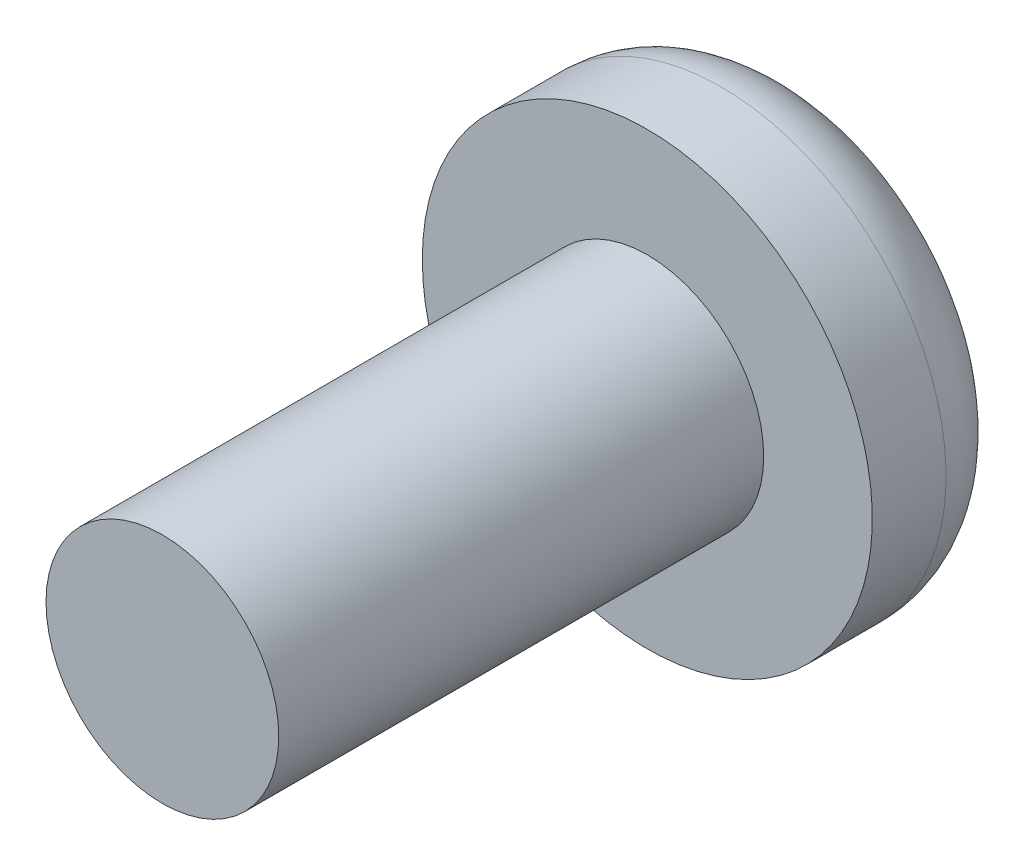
ISO-10303-21;
HEADER;
FILE_DESCRIPTION(('STEP AP214'),'2;1');
FILE_NAME('part.step','',(''),(''),'','','');
FILE_SCHEMA(('AUTOMOTIVE_DESIGN { 1 0 10303 214 1 1 1 1 }'));
ENDSEC;
DATA;
#1=APPLICATION_CONTEXT('core data for automotive mechanical design processes');
#2=APPLICATION_PROTOCOL_DEFINITION('international standard','automotive_design',2000,#1);
#3=PRODUCT_CONTEXT('',#1,'mechanical');
#4=PRODUCT('Part','Part','',(#3));
#5=PRODUCT_RELATED_PRODUCT_CATEGORY('part','',(#4));
#6=PRODUCT_DEFINITION_FORMATION('','',#4);
#7=PRODUCT_DEFINITION_CONTEXT('part definition',#1,'design');
#8=PRODUCT_DEFINITION('design','',#6,#7);
#9=PRODUCT_DEFINITION_SHAPE('','',#8);
#10=(LENGTH_UNIT() NAMED_UNIT(*) SI_UNIT(.MILLI.,.METRE.));
#11=(NAMED_UNIT(*) PLANE_ANGLE_UNIT() SI_UNIT($,.RADIAN.));
#12=(NAMED_UNIT(*) SI_UNIT($,.STERADIAN.) SOLID_ANGLE_UNIT());
#13=UNCERTAINTY_MEASURE_WITH_UNIT(LENGTH_MEASURE(1.E-05),#10,'distance_accuracy_value','');
#14=(GEOMETRIC_REPRESENTATION_CONTEXT(3) GLOBAL_UNCERTAINTY_ASSIGNED_CONTEXT((#13)) GLOBAL_UNIT_ASSIGNED_CONTEXT((#10,
#11,#12)) REPRESENTATION_CONTEXT('',''));
#15=CARTESIAN_POINT('',(0.,0.,0.));
#16=DIRECTION('',(0.,0.,1.));
#17=DIRECTION('',(1.,0.,0.));
#18=AXIS2_PLACEMENT_3D('',#15,#16,#17);
#19=CARTESIAN_POINT('',(0.,0.,-0.990600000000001));
#20=DIRECTION('',(0.,0.,-0.999999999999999));
#21=DIRECTION('',(-1.,0.,0.));
#22=AXIS2_PLACEMENT_3D('',#19,#20,#21);
#23=PLANE('',#22);
#24=CARTESIAN_POINT('',(0.,0.,-0.990600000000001));
#25=DIRECTION('',(0.,0.,-0.999999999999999));
#26=DIRECTION('',(-1.,0.,0.));
#27=AXIS2_PLACEMENT_3D('',#24,#25,#26);
#28=CIRCLE('',#27,0.965200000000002);
#29=CARTESIAN_POINT('',(-0.96519999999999,0.,-0.990600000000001));
#30=VERTEX_POINT('',#29);
#31=EDGE_CURVE('E43',#30,#30,#28,.T.);
#32=ORIENTED_EDGE('',*,*,#31,.T.);
#33=EDGE_LOOP('',(#32));
#34=FACE_BOUND('',#33,.T.);
#35=DIRECTION('',(0.,-1.,0.));
#36=VECTOR('',#35,1.);
#37=CARTESIAN_POINT('',(0.761999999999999,0.228599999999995,-0.990599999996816));
#38=LINE('',#37,#36);
#39=CARTESIAN_POINT('',(0.761999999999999,0.228599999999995,-0.990599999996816));
#40=VERTEX_POINT('',#39);
#41=CARTESIAN_POINT('',(0.761999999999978,-0.228600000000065,-0.990599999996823));
#42=VERTEX_POINT('',#41);
#43=EDGE_CURVE('E194',#40,#42,#38,.T.);
#44=ORIENTED_EDGE('',*,*,#43,.F.);
#45=DIRECTION('',(-1.,0.,0.));
#46=VECTOR('',#45,1.);
#47=CARTESIAN_POINT('',(0.761999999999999,0.228599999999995,-0.990599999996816));
#48=LINE('',#47,#46);
#49=CARTESIAN_POINT('',(0.228600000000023,0.228599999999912,-0.990599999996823));
#50=VERTEX_POINT('',#49);
#51=EDGE_CURVE('E188',#40,#50,#48,.T.);
#52=ORIENTED_EDGE('',*,*,#51,.T.);
#53=DIRECTION('',(0.,1.,0.));
#54=VECTOR('',#53,1.);
#55=CARTESIAN_POINT('',(0.228600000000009,0.,-0.990599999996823));
#56=LINE('',#55,#54);
#57=CARTESIAN_POINT('',(0.228600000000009,0.761999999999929,-0.990599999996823));
#58=VERTEX_POINT('',#57);
#59=EDGE_CURVE('E63',#50,#58,#56,.T.);
#60=ORIENTED_EDGE('',*,*,#59,.T.);
#61=DIRECTION('',(1.,0.,0.));
#62=VECTOR('',#61,1.);
#63=CARTESIAN_POINT('',(-0.228599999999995,0.761999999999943,-0.990599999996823));
#64=LINE('',#63,#62);
#65=CARTESIAN_POINT('',(-0.228599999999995,0.761999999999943,-0.990599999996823));
#66=VERTEX_POINT('',#65);
#67=EDGE_CURVE('E215',#66,#58,#64,.T.);
#68=ORIENTED_EDGE('',*,*,#67,.F.);
#69=DIRECTION('',(0.,-1.,0.));
#70=VECTOR('',#69,1.);
#71=CARTESIAN_POINT('',(-0.228599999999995,0.761999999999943,-0.990599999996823));
#72=LINE('',#71,#70);
#73=CARTESIAN_POINT('',(-0.228600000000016,0.22859999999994,-0.990599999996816));
#74=VERTEX_POINT('',#73);
#75=EDGE_CURVE('E209',#66,#74,#72,.T.);
#76=ORIENTED_EDGE('',*,*,#75,.T.);
#77=CARTESIAN_POINT('',(-0.761999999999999,0.228599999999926,-0.990599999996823));
#78=VERTEX_POINT('',#77);
#79=EDGE_CURVE('E197',#74,#78,#48,.T.);
#80=ORIENTED_EDGE('',*,*,#79,.T.);
#81=DIRECTION('',(0.,1.,0.));
#82=VECTOR('',#81,1.);
#83=CARTESIAN_POINT('',(-0.762000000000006,-0.228600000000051,-0.990599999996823));
#84=LINE('',#83,#82);
#85=CARTESIAN_POINT('',(-0.762000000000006,-0.228600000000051,-0.990599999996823));
#86=VERTEX_POINT('',#85);
#87=EDGE_CURVE('E142',#86,#78,#84,.T.);
#88=ORIENTED_EDGE('',*,*,#87,.F.);
#89=DIRECTION('',(1.,0.,0.));
#90=VECTOR('',#89,1.);
#91=CARTESIAN_POINT('',(-0.762000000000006,-0.228600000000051,-0.990599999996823));
#92=LINE('',#91,#90);
#93=CARTESIAN_POINT('',(-0.228600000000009,-0.228600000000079,-0.990599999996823));
#94=VERTEX_POINT('',#93);
#95=EDGE_CURVE('E153',#86,#94,#92,.T.);
#96=ORIENTED_EDGE('',*,*,#95,.T.);
#97=DIRECTION('',(0.,-0.999999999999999,0.));
#98=VECTOR('',#97,1.);
#99=CARTESIAN_POINT('',(-0.228599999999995,0.,-0.990599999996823));
#100=LINE('',#99,#98);
#101=CARTESIAN_POINT('',(-0.228600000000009,-0.76200000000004,-0.990599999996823));
#102=VERTEX_POINT('',#101);
#103=EDGE_CURVE('E162',#94,#102,#100,.T.);
#104=ORIENTED_EDGE('',*,*,#103,.T.);
#105=DIRECTION('',(-1.,0.,0.));
#106=VECTOR('',#105,1.);
#107=CARTESIAN_POINT('',(0.228599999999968,-0.762000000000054,-0.990599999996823));
#108=LINE('',#107,#106);
#109=CARTESIAN_POINT('',(0.228599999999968,-0.762000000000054,-0.990599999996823));
#110=VERTEX_POINT('',#109);
#111=EDGE_CURVE('E175',#110,#102,#108,.T.);
#112=ORIENTED_EDGE('',*,*,#111,.F.);
#113=DIRECTION('',(0.,1.,0.));
#114=VECTOR('',#113,1.);
#115=CARTESIAN_POINT('',(0.228599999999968,-0.762000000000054,-0.990599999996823));
#116=LINE('',#115,#114);
#117=CARTESIAN_POINT('',(0.228600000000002,-0.228600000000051,-0.990599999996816));
#118=VERTEX_POINT('',#117);
#119=EDGE_CURVE('E166',#110,#118,#116,.T.);
#120=ORIENTED_EDGE('',*,*,#119,.T.);
#121=DIRECTION('',(1.,0.,0.));
#122=VECTOR('',#121,1.);
#123=CARTESIAN_POINT('',(0.,-0.228600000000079,-0.990599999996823));
#124=LINE('',#123,#122);
#125=EDGE_CURVE('E185',#118,#42,#124,.T.);
#126=ORIENTED_EDGE('',*,*,#125,.T.);
#127=EDGE_LOOP('',(#44,#52,#60,#68,#76,#80,#88,#96,#104,#112,#120,#126));
#128=FACE_BOUND('',#127,.T.);
#129=ADVANCED_FACE('F34',(#34,#128),#23,.T.);
#130=CARTESIAN_POINT('',(0.228600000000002,0.,-0.495299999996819));
#131=DIRECTION('',(-1.,0.,0.));
#132=DIRECTION('',(0.,-1.,0.));
#133=AXIS2_PLACEMENT_3D('',#130,#131,#132);
#134=PLANE('',#133);
#135=ORIENTED_EDGE('',*,*,#59,.F.);
#136=DIRECTION('',(0.,0.,0.999999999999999));
#137=VECTOR('',#136,1.);
#138=CARTESIAN_POINT('',(0.228600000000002,0.228599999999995,-0.495299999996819));
#139=LINE('',#138,#137);
#140=CARTESIAN_POINT('',(0.228600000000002,0.228599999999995,-0.495299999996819));
#141=VERTEX_POINT('',#140);
#142=EDGE_CURVE('E203',#50,#141,#139,.T.);
#143=ORIENTED_EDGE('',*,*,#142,.T.);
#144=DIRECTION('',(0.,1.,0.));
#145=VECTOR('',#144,1.);
#146=CARTESIAN_POINT('',(0.228600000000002,0.,-0.495299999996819));
#147=LINE('',#146,#145);
#148=CARTESIAN_POINT('',(0.228599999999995,0.761999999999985,-0.495299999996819));
#149=VERTEX_POINT('',#148);
#150=EDGE_CURVE('E206',#141,#149,#147,.T.);
#151=ORIENTED_EDGE('',*,*,#150,.T.);
#152=DIRECTION('',(0.,0.,-0.999999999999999));
#153=VECTOR('',#152,1.);
#154=CARTESIAN_POINT('',(0.228599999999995,0.761999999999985,-0.495299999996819));
#155=LINE('',#154,#153);
#156=EDGE_CURVE('E221',#149,#58,#155,.T.);
#157=ORIENTED_EDGE('',*,*,#156,.T.);
#158=EDGE_LOOP('',(#135,#143,#151,#157));
#159=FACE_BOUND('',#158,.T.);
#160=ADVANCED_FACE('F250',(#159),#134,.T.);
#161=CARTESIAN_POINT('',(-0.228600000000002,0.762000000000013,-0.495299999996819));
#162=DIRECTION('',(1.,0.,0.));
#163=DIRECTION('',(0.,1.,0.));
#164=AXIS2_PLACEMENT_3D('',#161,#162,#163);
#165=PLANE('',#164);
#166=DIRECTION('',(0.,-1.,0.));
#167=VECTOR('',#166,1.);
#168=CARTESIAN_POINT('',(-0.228600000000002,0.762000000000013,-0.495299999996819));
#169=LINE('',#168,#167);
#170=CARTESIAN_POINT('',(-0.228600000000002,0.762000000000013,-0.495299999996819));
#171=VERTEX_POINT('',#170);
#172=CARTESIAN_POINT('',(-0.228600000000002,0.228599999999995,-0.495299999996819));
#173=VERTEX_POINT('',#172);
#174=EDGE_CURVE('E212',#171,#173,#169,.T.);
#175=ORIENTED_EDGE('',*,*,#174,.T.);
#176=DIRECTION('',(0.,0.,-0.999999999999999));
#177=VECTOR('',#176,1.);
#178=CARTESIAN_POINT('',(-0.228600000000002,0.228599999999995,-0.495299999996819));
#179=LINE('',#178,#177);
#180=EDGE_CURVE('E71',#173,#74,#179,.T.);
#181=ORIENTED_EDGE('',*,*,#180,.T.);
#182=ORIENTED_EDGE('',*,*,#75,.F.);
#183=DIRECTION('',(0.,0.,-0.999999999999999));
#184=VECTOR('',#183,1.);
#185=CARTESIAN_POINT('',(-0.228600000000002,0.762000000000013,-0.495299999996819));
#186=LINE('',#185,#184);
#187=EDGE_CURVE('E51',#171,#66,#186,.T.);
#188=ORIENTED_EDGE('',*,*,#187,.F.);
#189=EDGE_LOOP('',(#175,#181,#182,#188));
#190=FACE_BOUND('',#189,.T.);
#191=ADVANCED_FACE('F255',(#190),#165,.T.);
#192=CARTESIAN_POINT('',(0.,0.,3.17499999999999));
#193=DIRECTION('',(0.,0.,-0.999999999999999));
#194=DIRECTION('',(-1.,0.,0.));
#195=AXIS2_PLACEMENT_3D('',#192,#193,#194);
#196=CYLINDRICAL_SURFACE('',#195,0.762);
#197=CARTESIAN_POINT('',(0.,0.,3.17499999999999));
#198=DIRECTION('',(0.,0.,0.999999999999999));
#199=DIRECTION('',(1.,0.,0.));
#200=AXIS2_PLACEMENT_3D('',#197,#198,#199);
#201=CIRCLE('',#200,0.762);
#202=CARTESIAN_POINT('',(-0.762000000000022,0.,3.17499999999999));
#203=VERTEX_POINT('',#202);
#204=EDGE_CURVE('E229',#203,#203,#201,.T.);
#205=CARTESIAN_POINT('',(0.,0.,0.));
#206=DIRECTION('',(0.,0.,0.999999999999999));
#207=DIRECTION('',(1.,0.,0.));
#208=AXIS2_PLACEMENT_3D('',#205,#206,#207);
#209=CIRCLE('',#208,0.762);
#210=CARTESIAN_POINT('',(-0.76200000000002,0.,0.));
#211=VERTEX_POINT('',#210);
#212=EDGE_CURVE('E226',#211,#211,#209,.T.);
#213=CARTESIAN_POINT('',(-0.762000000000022,0.,3.17499999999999));
#214=CARTESIAN_POINT('',(-0.762000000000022,0.,3.14192708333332));
#215=CARTESIAN_POINT('',(-0.762000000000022,0.,3.10885416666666));
#216=CARTESIAN_POINT('',(-0.762000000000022,0.,3.04270833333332));
#217=CARTESIAN_POINT('',(-0.762000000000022,0.,3.00963541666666));
#218=CARTESIAN_POINT('',(-0.762000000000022,0.,2.94348958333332));
#219=CARTESIAN_POINT('',(-0.762000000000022,0.,2.91041666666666));
#220=CARTESIAN_POINT('',(-0.762000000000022,0.,2.84427083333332));
#221=CARTESIAN_POINT('',(-0.762000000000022,0.,2.81119791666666));
#222=CARTESIAN_POINT('',(-0.762000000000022,0.,2.74505208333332));
#223=CARTESIAN_POINT('',(-0.762000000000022,0.,2.71197916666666));
#224=CARTESIAN_POINT('',(-0.762000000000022,0.,2.64583333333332));
#225=CARTESIAN_POINT('',(-0.762000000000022,0.,2.61276041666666));
#226=CARTESIAN_POINT('',(-0.762000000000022,0.,2.54661458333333));
#227=CARTESIAN_POINT('',(-0.762000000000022,0.,2.51354166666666));
#228=CARTESIAN_POINT('',(-0.762000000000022,0.,2.44739583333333));
#229=CARTESIAN_POINT('',(-0.762000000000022,0.,2.41432291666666));
#230=CARTESIAN_POINT('',(-0.762000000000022,0.,2.34817708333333));
#231=CARTESIAN_POINT('',(-0.762000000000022,0.,2.31510416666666));
#232=CARTESIAN_POINT('',(-0.762000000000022,0.,2.24895833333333));
#233=CARTESIAN_POINT('',(-0.762000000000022,0.,2.21588541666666));
#234=CARTESIAN_POINT('',(-0.762000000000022,0.,2.14973958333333));
#235=CARTESIAN_POINT('',(-0.762000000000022,0.,2.11666666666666));
#236=CARTESIAN_POINT('',(-0.762000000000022,0.,2.05052083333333));
#237=CARTESIAN_POINT('',(-0.762000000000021,0.,2.01744791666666));
#238=CARTESIAN_POINT('',(-0.762000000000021,0.,1.95130208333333));
#239=CARTESIAN_POINT('',(-0.762000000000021,0.,1.91822916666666));
#240=CARTESIAN_POINT('',(-0.762000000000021,0.,1.85208333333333));
#241=CARTESIAN_POINT('',(-0.762000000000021,0.,1.81901041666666));
#242=CARTESIAN_POINT('',(-0.762000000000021,0.,1.75286458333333));
#243=CARTESIAN_POINT('',(-0.762000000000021,0.,1.71979166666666));
#244=CARTESIAN_POINT('',(-0.762000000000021,0.,1.65364583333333));
#245=CARTESIAN_POINT('',(-0.762000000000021,0.,1.62057291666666));
#246=CARTESIAN_POINT('',(-0.762000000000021,0.,1.55442708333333));
#247=CARTESIAN_POINT('',(-0.762000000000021,0.,1.52135416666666));
#248=CARTESIAN_POINT('',(-0.762000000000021,0.,1.45520833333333));
#249=CARTESIAN_POINT('',(-0.762000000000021,0.,1.42213541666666));
#250=CARTESIAN_POINT('',(-0.762000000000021,0.,1.35598958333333));
#251=CARTESIAN_POINT('',(-0.762000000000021,0.,1.32291666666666));
#252=CARTESIAN_POINT('',(-0.762000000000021,0.,1.25677083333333));
#253=CARTESIAN_POINT('',(-0.762000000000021,0.,1.22369791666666));
#254=CARTESIAN_POINT('',(-0.762000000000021,0.,1.15755208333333));
#255=CARTESIAN_POINT('',(-0.762000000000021,0.,1.12447916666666));
#256=CARTESIAN_POINT('',(-0.762000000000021,0.,1.05833333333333));
#257=CARTESIAN_POINT('',(-0.762000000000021,0.,1.02526041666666));
#258=CARTESIAN_POINT('',(-0.762000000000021,0.,0.95911458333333));
#259=CARTESIAN_POINT('',(-0.762000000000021,0.,0.926041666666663));
#260=CARTESIAN_POINT('',(-0.762000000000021,0.,0.85989583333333));
#261=CARTESIAN_POINT('',(-0.762000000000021,0.,0.826822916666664));
#262=CARTESIAN_POINT('',(-0.762000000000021,0.,0.760677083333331));
#263=CARTESIAN_POINT('',(-0.762000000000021,0.,0.727604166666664));
#264=CARTESIAN_POINT('',(-0.762000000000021,0.,0.661458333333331));
#265=CARTESIAN_POINT('',(-0.762000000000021,0.,0.628385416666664));
#266=CARTESIAN_POINT('',(-0.762000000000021,0.,0.562239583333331));
#267=CARTESIAN_POINT('',(-0.762000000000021,0.,0.529166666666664));
#268=CARTESIAN_POINT('',(-0.762000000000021,0.,0.463020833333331));
#269=CARTESIAN_POINT('',(-0.76200000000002,0.,0.429947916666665));
#270=CARTESIAN_POINT('',(-0.76200000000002,0.,0.363802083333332));
#271=CARTESIAN_POINT('',(-0.76200000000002,0.,0.330729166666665));
#272=CARTESIAN_POINT('',(-0.76200000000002,0.,0.264583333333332));
#273=CARTESIAN_POINT('',(-0.76200000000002,0.,0.231510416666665));
#274=CARTESIAN_POINT('',(-0.76200000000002,0.,0.165364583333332));
#275=CARTESIAN_POINT('',(-0.76200000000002,0.,0.132291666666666));
#276=CARTESIAN_POINT('',(-0.76200000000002,0.,0.0661458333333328));
#277=CARTESIAN_POINT('',(-0.76200000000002,0.,0.0330729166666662));
#278=CARTESIAN_POINT('',(-0.76200000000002,0.,0.));
#279=B_SPLINE_CURVE_WITH_KNOTS('',3,(#213,#214,#215,#216,#217,#218,#219,#220,#221,#222,#223,
#224,#225,#226,#227,#228,#229,#230,#231,#232,#233,#234,#235,#236,#237,#238,#239,#240,#241,#242,
#243,#244,#245,#246,#247,#248,#249,#250,#251,#252,#253,#254,#255,#256,#257,#258,#259,#260,#261,
#262,#263,#264,#265,#266,#267,#268,#269,#270,#271,#272,#273,#274,#275,#276,#277,#278),
.UNSPECIFIED.,.F.,.F.,(4,2,2,2,2,2,2,2,2,2,2,2,2,2,2,2,2,2,2,2,2,2,2,2,2,2,2,2,2,2,2,2,4),(0.,
0.0992187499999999,0.198437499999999,0.297656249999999,0.396874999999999,0.496093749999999,
0.595312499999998,0.694531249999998,0.793749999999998,0.892968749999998,0.992187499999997,
1.09140625,1.190625,1.28984375,1.3890625,1.48828125,1.5875,1.68671875,1.7859375,
1.88515624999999,1.98437499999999,2.08359374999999,2.18281249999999,2.28203124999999,
2.38124999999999,2.48046874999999,2.57968749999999,2.67890624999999,2.77812499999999,
2.87734374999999,2.97656249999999,3.07578124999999,3.17499999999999),.UNSPECIFIED.);
#280=EDGE_CURVE('BSEAM262',#203,#211,#279,.T.);
#281=ORIENTED_EDGE('',*,*,#204,.F.);
#282=ORIENTED_EDGE('',*,*,#212,.T.);
#283=ORIENTED_EDGE('',*,*,#280,.T.);
#284=ORIENTED_EDGE('',*,*,#280,.F.);
#285=EDGE_LOOP('',(#281,#283,#282,#284));
#286=FACE_BOUND('',#285,.T.);
#287=ADVANCED_FACE('F262',(#286),#196,.T.);
#288=CARTESIAN_POINT('',(0.,0.,3.17499999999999));
#289=DIRECTION('',(0.,0.,0.999999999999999));
#290=DIRECTION('',(1.,0.,0.));
#291=AXIS2_PLACEMENT_3D('',#288,#289,#290);
#292=PLANE('',#291);
#293=ORIENTED_EDGE('',*,*,#204,.T.);
#294=EDGE_LOOP('',(#293));
#295=FACE_BOUND('',#294,.T.);
#296=ADVANCED_FACE('F260',(#295),#292,.T.);
#297=CARTESIAN_POINT('',(1.47319999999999,0.,0.));
#298=DIRECTION('',(0.,0.,0.999999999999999));
#299=DIRECTION('',(1.,0.,0.));
#300=AXIS2_PLACEMENT_3D('',#297,#298,#299);
#301=PLANE('',#300);
#302=CARTESIAN_POINT('',(0.,0.,0.));
#303=DIRECTION('',(0.,0.,-0.999999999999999));
#304=DIRECTION('',(-1.,0.,0.));
#305=AXIS2_PLACEMENT_3D('',#302,#303,#304);
#306=CIRCLE('',#305,1.4732);
#307=CARTESIAN_POINT('',(-1.4732,0.,0.));
#308=VERTEX_POINT('',#307);
#309=EDGE_CURVE('E223',#308,#308,#306,.T.);
#310=ORIENTED_EDGE('',*,*,#309,.F.);
#311=EDGE_LOOP('',(#310));
#312=FACE_BOUND('',#311,.T.);
#313=ORIENTED_EDGE('',*,*,#212,.F.);
#314=EDGE_LOOP('',(#313));
#315=FACE_BOUND('',#314,.T.);
#316=ADVANCED_FACE('F245',(#312,#315),#301,.T.);
#317=CARTESIAN_POINT('',(0.,0.,-4.84031750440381));
#318=DIRECTION('',(0.,0.,-0.999999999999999));
#319=DIRECTION('',(-1.,0.,0.));
#320=AXIS2_PLACEMENT_3D('',#317,#318,#319);
#321=CYLINDRICAL_SURFACE('',#320,1.4732);
#322=CARTESIAN_POINT('',(0.,0.,-0.4826));
#323=DIRECTION('',(0.,0.,-0.999999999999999));
#324=DIRECTION('',(-1.,0.,0.));
#325=AXIS2_PLACEMENT_3D('',#322,#323,#324);
#326=CIRCLE('',#325,1.4732);
#327=CARTESIAN_POINT('',(-1.4732,0.,-0.482600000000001));
#328=VERTEX_POINT('',#327);
#329=EDGE_CURVE('E11',#328,#328,#326,.F.);
#330=CARTESIAN_POINT('',(-1.4732,0.,-0.482600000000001));
#331=CARTESIAN_POINT('',(-1.4732,0.,-0.477572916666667));
#332=CARTESIAN_POINT('',(-1.4732,0.,-0.472545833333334));
#333=CARTESIAN_POINT('',(-1.4732,0.,-0.462491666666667));
#334=CARTESIAN_POINT('',(-1.4732,0.,-0.457464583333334));
#335=CARTESIAN_POINT('',(-1.4732,0.,-0.447410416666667));
#336=CARTESIAN_POINT('',(-1.4732,0.,-0.442383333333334));
#337=CARTESIAN_POINT('',(-1.4732,0.,-0.432329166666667));
#338=CARTESIAN_POINT('',(-1.4732,0.,-0.427302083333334));
#339=CARTESIAN_POINT('',(-1.4732,0.,-0.417247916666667));
#340=CARTESIAN_POINT('',(-1.4732,0.,-0.412220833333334));
#341=CARTESIAN_POINT('',(-1.4732,0.,-0.402166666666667));
#342=CARTESIAN_POINT('',(-1.4732,0.,-0.397139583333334));
#343=CARTESIAN_POINT('',(-1.4732,0.,-0.387085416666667));
#344=CARTESIAN_POINT('',(-1.4732,0.,-0.382058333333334));
#345=CARTESIAN_POINT('',(-1.4732,0.,-0.372004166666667));
#346=CARTESIAN_POINT('',(-1.4732,0.,-0.366977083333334));
#347=CARTESIAN_POINT('',(-1.4732,0.,-0.356922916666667));
#348=CARTESIAN_POINT('',(-1.4732,0.,-0.351895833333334));
#349=CARTESIAN_POINT('',(-1.4732,0.,-0.341841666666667));
#350=CARTESIAN_POINT('',(-1.4732,0.,-0.336814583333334));
#351=CARTESIAN_POINT('',(-1.4732,0.,-0.326760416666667));
#352=CARTESIAN_POINT('',(-1.4732,0.,-0.321733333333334));
#353=CARTESIAN_POINT('',(-1.4732,0.,-0.311679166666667));
#354=CARTESIAN_POINT('',(-1.4732,0.,-0.306652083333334));
#355=CARTESIAN_POINT('',(-1.4732,0.,-0.296597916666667));
#356=CARTESIAN_POINT('',(-1.4732,0.,-0.291570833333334));
#357=CARTESIAN_POINT('',(-1.4732,0.,-0.281516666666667));
#358=CARTESIAN_POINT('',(-1.4732,0.,-0.276489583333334));
#359=CARTESIAN_POINT('',(-1.4732,0.,-0.266435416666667));
#360=CARTESIAN_POINT('',(-1.4732,0.,-0.261408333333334));
#361=CARTESIAN_POINT('',(-1.4732,0.,-0.251354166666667));
#362=CARTESIAN_POINT('',(-1.4732,0.,-0.246327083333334));
#363=CARTESIAN_POINT('',(-1.4732,0.,-0.236272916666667));
#364=CARTESIAN_POINT('',(-1.4732,0.,-0.231245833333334));
#365=CARTESIAN_POINT('',(-1.4732,0.,-0.221191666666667));
#366=CARTESIAN_POINT('',(-1.4732,0.,-0.216164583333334));
#367=CARTESIAN_POINT('',(-1.4732,0.,-0.206110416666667));
#368=CARTESIAN_POINT('',(-1.4732,0.,-0.201083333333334));
#369=CARTESIAN_POINT('',(-1.4732,0.,-0.191029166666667));
#370=CARTESIAN_POINT('',(-1.4732,0.,-0.186002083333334));
#371=CARTESIAN_POINT('',(-1.4732,0.,-0.175947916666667));
#372=CARTESIAN_POINT('',(-1.4732,0.,-0.170920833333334));
#373=CARTESIAN_POINT('',(-1.4732,0.,-0.160866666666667));
#374=CARTESIAN_POINT('',(-1.4732,0.,-0.155839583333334));
#375=CARTESIAN_POINT('',(-1.4732,0.,-0.145785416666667));
#376=CARTESIAN_POINT('',(-1.4732,0.,-0.140758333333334));
#377=CARTESIAN_POINT('',(-1.4732,0.,-0.130704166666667));
#378=CARTESIAN_POINT('',(-1.4732,0.,-0.125677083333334));
#379=CARTESIAN_POINT('',(-1.4732,0.,-0.115622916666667));
#380=CARTESIAN_POINT('',(-1.4732,0.,-0.110595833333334));
#381=CARTESIAN_POINT('',(-1.4732,0.,-0.100541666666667));
#382=CARTESIAN_POINT('',(-1.4732,0.,-0.0955145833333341));
#383=CARTESIAN_POINT('',(-1.4732,0.,-0.0854604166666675));
#384=CARTESIAN_POINT('',(-1.4732,0.,-0.0804333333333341));
#385=CARTESIAN_POINT('',(-1.4732,0.,-0.0703791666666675));
#386=CARTESIAN_POINT('',(-1.4732,0.,-0.0653520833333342));
#387=CARTESIAN_POINT('',(-1.4732,0.,-0.0552979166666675));
#388=CARTESIAN_POINT('',(-1.4732,0.,-0.0502708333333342));
#389=CARTESIAN_POINT('',(-1.4732,0.,-0.0402166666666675));
#390=CARTESIAN_POINT('',(-1.4732,0.,-0.0351895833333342));
#391=CARTESIAN_POINT('',(-1.4732,0.,-0.0251354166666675));
#392=CARTESIAN_POINT('',(-1.4732,0.,-0.0201083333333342));
#393=CARTESIAN_POINT('',(-1.4732,0.,-0.0100541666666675));
#394=CARTESIAN_POINT('',(-1.4732,0.,-0.0050270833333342));
#395=CARTESIAN_POINT('',(-1.4732,0.,0.));
#396=B_SPLINE_CURVE_WITH_KNOTS('',3,(#330,#331,#332,#333,#334,#335,#336,#337,#338,#339,#340,
#341,#342,#343,#344,#345,#346,#347,#348,#349,#350,#351,#352,#353,#354,#355,#356,#357,#358,#359,
#360,#361,#362,#363,#364,#365,#366,#367,#368,#369,#370,#371,#372,#373,#374,#375,#376,#377,#378,
#379,#380,#381,#382,#383,#384,#385,#386,#387,#388,#389,#390,#391,#392,#393,#394,#395),
.UNSPECIFIED.,.F.,.F.,(4,2,2,2,2,2,2,2,2,2,2,2,2,2,2,2,2,2,2,2,2,2,2,2,2,2,2,2,2,2,2,2,4),(0.,
0.01508125,0.0301625,0.04524375,0.060325,0.07540625,0.0904874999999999,0.10556875,0.12065,
0.13573125,0.1508125,0.16589375,0.180975,0.19605625,0.2111375,0.22621875,0.2413,0.25638125,
0.2714625,0.28654375,0.301625,0.31670625,0.3317875,0.34686875,0.36195,0.37703125,0.3921125,
0.40719375,0.422275,0.43735625,0.4524375,0.46751875,0.4826),.UNSPECIFIED.);
#397=EDGE_CURVE('BSEAM237',#328,#308,#396,.T.);
#398=ORIENTED_EDGE('',*,*,#329,.T.);
#399=ORIENTED_EDGE('',*,*,#309,.T.);
#400=ORIENTED_EDGE('',*,*,#397,.T.);
#401=ORIENTED_EDGE('',*,*,#397,.F.);
#402=EDGE_LOOP('',(#398,#400,#399,#401));
#403=FACE_BOUND('',#402,.T.);
#404=ADVANCED_FACE('F237',(#403),#321,.T.);
#405=CARTESIAN_POINT('',(0.,0.,-0.4826));
#406=DIRECTION('',(0.,0.,-0.999999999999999));
#407=DIRECTION('',(-1.,0.,0.));
#408=AXIS2_PLACEMENT_3D('',#405,#406,#407);
#409=TOROIDAL_SURFACE('',#408,0.965200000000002,0.508);
#410=ORIENTED_EDGE('',*,*,#329,.F.);
#411=EDGE_LOOP('',(#410));
#412=FACE_BOUND('',#411,.T.);
#413=ORIENTED_EDGE('',*,*,#31,.F.);
#414=EDGE_LOOP('',(#413));
#415=FACE_BOUND('',#414,.T.);
#416=ADVANCED_FACE('F36',(#412,#415),#409,.T.);
#417=CARTESIAN_POINT('',(-0.228600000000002,0.762000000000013,-0.495299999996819));
#418=DIRECTION('',(0.,1.,0.));
#419=DIRECTION('',(0.,0.,0.999999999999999));
#420=AXIS2_PLACEMENT_3D('',#417,#418,#419);
#421=PLANE('',#420);
#422=ORIENTED_EDGE('',*,*,#67,.T.);
#423=ORIENTED_EDGE('',*,*,#156,.F.);
#424=DIRECTION('',(1.,0.,0.));
#425=VECTOR('',#424,1.);
#426=CARTESIAN_POINT('',(-0.228600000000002,0.762000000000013,-0.495299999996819));
#427=LINE('',#426,#425);
#428=EDGE_CURVE('E208',#171,#149,#427,.T.);
#429=ORIENTED_EDGE('',*,*,#428,.F.);
#430=ORIENTED_EDGE('',*,*,#187,.T.);
#431=EDGE_LOOP('',(#422,#423,#429,#430));
#432=FACE_BOUND('',#431,.T.);
#433=ADVANCED_FACE('F236',(#432),#421,.F.);
#434=CARTESIAN_POINT('',(0.228600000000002,0.,-0.495299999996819));
#435=DIRECTION('',(0.,0.,0.999999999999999));
#436=DIRECTION('',(1.,0.,0.));
#437=AXIS2_PLACEMENT_3D('',#434,#435,#436);
#438=PLANE('',#437);
#439=ORIENTED_EDGE('',*,*,#150,.F.);
#440=DIRECTION('',(-1.,0.,0.));
#441=VECTOR('',#440,1.);
#442=CARTESIAN_POINT('',(0.762000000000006,0.228599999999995,-0.495299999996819));
#443=LINE('',#442,#441);
#444=CARTESIAN_POINT('',(0.762000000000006,0.228599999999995,-0.495299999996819));
#445=VERTEX_POINT('',#444);
#446=EDGE_CURVE('E134',#445,#141,#443,.T.);
#447=ORIENTED_EDGE('',*,*,#446,.F.);
#448=DIRECTION('',(0.,-1.,0.));
#449=VECTOR('',#448,1.);
#450=CARTESIAN_POINT('',(0.762000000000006,0.228599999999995,-0.495299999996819));
#451=LINE('',#450,#449);
#452=CARTESIAN_POINT('',(0.761999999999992,-0.228599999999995,-0.495299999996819));
#453=VERTEX_POINT('',#452);
#454=EDGE_CURVE('E135',#445,#453,#451,.T.);
#455=ORIENTED_EDGE('',*,*,#454,.T.);
#456=DIRECTION('',(1.,0.,0.));
#457=VECTOR('',#456,1.);
#458=CARTESIAN_POINT('',(0.,-0.228600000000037,-0.495299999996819));
#459=LINE('',#458,#457);
#460=CARTESIAN_POINT('',(0.228600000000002,-0.228599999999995,-0.495299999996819));
#461=VERTEX_POINT('',#460);
#462=EDGE_CURVE('E186',#461,#453,#459,.T.);
#463=ORIENTED_EDGE('',*,*,#462,.F.);
#464=DIRECTION('',(0.,1.,0.));
#465=VECTOR('',#464,1.);
#466=CARTESIAN_POINT('',(0.228599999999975,-0.762000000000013,-0.495299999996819));
#467=LINE('',#466,#465);
#468=CARTESIAN_POINT('',(0.228599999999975,-0.762000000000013,-0.495299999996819));
#469=VERTEX_POINT('',#468);
#470=EDGE_CURVE('E169',#469,#461,#467,.T.);
#471=ORIENTED_EDGE('',*,*,#470,.F.);
#472=DIRECTION('',(-1.,0.,0.));
#473=VECTOR('',#472,1.);
#474=CARTESIAN_POINT('',(0.228599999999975,-0.762000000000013,-0.495299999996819));
#475=LINE('',#474,#473);
#476=CARTESIAN_POINT('',(-0.228600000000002,-0.76200000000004,-0.495299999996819));
#477=VERTEX_POINT('',#476);
#478=EDGE_CURVE('E165',#469,#477,#475,.T.);
#479=ORIENTED_EDGE('',*,*,#478,.T.);
#480=DIRECTION('',(0.,-0.999999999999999,0.));
#481=VECTOR('',#480,1.);
#482=CARTESIAN_POINT('',(-0.228600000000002,0.,-0.495299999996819));
#483=LINE('',#482,#481);
#484=CARTESIAN_POINT('',(-0.228600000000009,-0.228600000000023,-0.495299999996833));
#485=VERTEX_POINT('',#484);
#486=EDGE_CURVE('E163',#485,#477,#483,.T.);
#487=ORIENTED_EDGE('',*,*,#486,.F.);
#488=DIRECTION('',(1.,0.,0.));
#489=VECTOR('',#488,1.);
#490=CARTESIAN_POINT('',(-0.761999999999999,-0.228600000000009,-0.495299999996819));
#491=LINE('',#490,#489);
#492=CARTESIAN_POINT('',(-0.761999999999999,-0.228600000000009,-0.495299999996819));
#493=VERTEX_POINT('',#492);
#494=EDGE_CURVE('E152',#493,#485,#491,.T.);
#495=ORIENTED_EDGE('',*,*,#494,.F.);
#496=DIRECTION('',(0.,1.,0.));
#497=VECTOR('',#496,1.);
#498=CARTESIAN_POINT('',(-0.761999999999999,-0.228600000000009,-0.495299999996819));
#499=LINE('',#498,#497);
#500=CARTESIAN_POINT('',(-0.761999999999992,0.228599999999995,-0.495299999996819));
#501=VERTEX_POINT('',#500);
#502=EDGE_CURVE('E140',#493,#501,#499,.T.);
#503=ORIENTED_EDGE('',*,*,#502,.T.);
#504=EDGE_CURVE('E127',#173,#501,#443,.T.);
#505=ORIENTED_EDGE('',*,*,#504,.F.);
#506=ORIENTED_EDGE('',*,*,#174,.F.);
#507=ORIENTED_EDGE('',*,*,#428,.T.);
#508=EDGE_LOOP('',(#439,#447,#455,#463,#471,#479,#487,#495,#503,#505,#506,#507));
#509=FACE_BOUND('',#508,.T.);
#510=ADVANCED_FACE('F149',(#509),#438,.F.);
#511=CARTESIAN_POINT('',(0.762000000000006,0.228599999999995,-0.495299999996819));
#512=DIRECTION('',(0.,-1.,0.));
#513=DIRECTION('',(1.,0.,0.));
#514=AXIS2_PLACEMENT_3D('',#511,#512,#513);
#515=PLANE('',#514);
#516=ORIENTED_EDGE('',*,*,#51,.F.);
#517=DIRECTION('',(0.,0.,-0.999999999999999));
#518=VECTOR('',#517,1.);
#519=CARTESIAN_POINT('',(0.762000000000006,0.228599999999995,-0.495299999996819));
#520=LINE('',#519,#518);
#521=EDGE_CURVE('E191',#445,#40,#520,.T.);
#522=ORIENTED_EDGE('',*,*,#521,.F.);
#523=ORIENTED_EDGE('',*,*,#446,.T.);
#524=ORIENTED_EDGE('',*,*,#142,.F.);
#525=EDGE_LOOP('',(#516,#522,#523,#524));
#526=FACE_BOUND('',#525,.T.);
#527=ADVANCED_FACE('F282',(#526),#515,.T.);
#528=CARTESIAN_POINT('',(0.,-0.228600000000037,-0.495299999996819));
#529=DIRECTION('',(0.,1.,0.));
#530=DIRECTION('',(-1.,0.,0.));
#531=AXIS2_PLACEMENT_3D('',#528,#529,#530);
#532=PLANE('',#531);
#533=DIRECTION('',(0.,0.,0.999999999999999));
#534=VECTOR('',#533,1.);
#535=CARTESIAN_POINT('',(0.228600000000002,-0.228599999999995,-0.495299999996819));
#536=LINE('',#535,#534);
#537=EDGE_CURVE('E183',#118,#461,#536,.T.);
#538=ORIENTED_EDGE('',*,*,#537,.T.);
#539=ORIENTED_EDGE('',*,*,#462,.T.);
#540=DIRECTION('',(0.,0.,-0.999999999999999));
#541=VECTOR('',#540,1.);
#542=CARTESIAN_POINT('',(0.761999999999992,-0.228599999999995,-0.495299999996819));
#543=LINE('',#542,#541);
#544=EDGE_CURVE('E200',#453,#42,#543,.T.);
#545=ORIENTED_EDGE('',*,*,#544,.T.);
#546=ORIENTED_EDGE('',*,*,#125,.F.);
#547=EDGE_LOOP('',(#538,#539,#545,#546));
#548=FACE_BOUND('',#547,.T.);
#549=ADVANCED_FACE('F283',(#548),#532,.T.);
#550=CARTESIAN_POINT('',(0.762000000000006,0.228599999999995,-0.495299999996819));
#551=DIRECTION('',(1.,0.,0.));
#552=DIRECTION('',(0.,1.,0.));
#553=AXIS2_PLACEMENT_3D('',#550,#551,#552);
#554=PLANE('',#553);
#555=ORIENTED_EDGE('',*,*,#43,.T.);
#556=ORIENTED_EDGE('',*,*,#544,.F.);
#557=ORIENTED_EDGE('',*,*,#454,.F.);
#558=ORIENTED_EDGE('',*,*,#521,.T.);
#559=EDGE_LOOP('',(#555,#556,#557,#558));
#560=FACE_BOUND('',#559,.T.);
#561=ADVANCED_FACE('F286',(#560),#554,.F.);
#562=ORIENTED_EDGE('',*,*,#504,.T.);
#563=DIRECTION('',(0.,0.,-0.999999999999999));
#564=VECTOR('',#563,1.);
#565=CARTESIAN_POINT('',(-0.761999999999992,0.228599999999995,-0.495299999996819));
#566=LINE('',#565,#564);
#567=EDGE_CURVE('E130',#501,#78,#566,.T.);
#568=ORIENTED_EDGE('',*,*,#567,.T.);
#569=ORIENTED_EDGE('',*,*,#79,.F.);
#570=ORIENTED_EDGE('',*,*,#180,.F.);
#571=EDGE_LOOP('',(#562,#568,#569,#570));
#572=FACE_BOUND('',#571,.T.);
#573=ADVANCED_FACE('F129',(#572),#515,.T.);
#574=CARTESIAN_POINT('',(0.228599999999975,-0.762000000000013,-0.495299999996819));
#575=DIRECTION('',(-1.,0.,0.));
#576=DIRECTION('',(0.,-1.,0.));
#577=AXIS2_PLACEMENT_3D('',#574,#575,#576);
#578=PLANE('',#577);
#579=ORIENTED_EDGE('',*,*,#119,.F.);
#580=DIRECTION('',(0.,0.,-0.999999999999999));
#581=VECTOR('',#580,1.);
#582=CARTESIAN_POINT('',(0.228599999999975,-0.762000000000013,-0.495299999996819));
#583=LINE('',#582,#581);
#584=EDGE_CURVE('E172',#469,#110,#583,.T.);
#585=ORIENTED_EDGE('',*,*,#584,.F.);
#586=ORIENTED_EDGE('',*,*,#470,.T.);
#587=ORIENTED_EDGE('',*,*,#537,.F.);
#588=EDGE_LOOP('',(#579,#585,#586,#587));
#589=FACE_BOUND('',#588,.T.);
#590=ADVANCED_FACE('F293',(#589),#578,.T.);
#591=CARTESIAN_POINT('',(-0.228600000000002,0.,-0.495299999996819));
#592=DIRECTION('',(1.,0.,0.));
#593=DIRECTION('',(0.,0.999999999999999,0.));
#594=AXIS2_PLACEMENT_3D('',#591,#592,#593);
#595=PLANE('',#594);
#596=DIRECTION('',(0.,0.,0.999999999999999));
#597=VECTOR('',#596,1.);
#598=CARTESIAN_POINT('',(-0.228600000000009,-0.228600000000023,-0.495299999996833));
#599=LINE('',#598,#597);
#600=EDGE_CURVE('E144',#94,#485,#599,.T.);
#601=ORIENTED_EDGE('',*,*,#600,.T.);
#602=ORIENTED_EDGE('',*,*,#486,.T.);
#603=DIRECTION('',(0.,0.,-0.999999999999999));
#604=VECTOR('',#603,1.);
#605=CARTESIAN_POINT('',(-0.228600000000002,-0.76200000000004,-0.495299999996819));
#606=LINE('',#605,#604);
#607=EDGE_CURVE('E181',#477,#102,#606,.T.);
#608=ORIENTED_EDGE('',*,*,#607,.T.);
#609=ORIENTED_EDGE('',*,*,#103,.F.);
#610=EDGE_LOOP('',(#601,#602,#608,#609));
#611=FACE_BOUND('',#610,.T.);
#612=ADVANCED_FACE('F294',(#611),#595,.T.);
#613=CARTESIAN_POINT('',(0.228599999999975,-0.762000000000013,-0.495299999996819));
#614=DIRECTION('',(0.,-1.,0.));
#615=DIRECTION('',(1.,0.,0.));
#616=AXIS2_PLACEMENT_3D('',#613,#614,#615);
#617=PLANE('',#616);
#618=ORIENTED_EDGE('',*,*,#111,.T.);
#619=ORIENTED_EDGE('',*,*,#607,.F.);
#620=ORIENTED_EDGE('',*,*,#478,.F.);
#621=ORIENTED_EDGE('',*,*,#584,.T.);
#622=EDGE_LOOP('',(#618,#619,#620,#621));
#623=FACE_BOUND('',#622,.T.);
#624=ADVANCED_FACE('F297',(#623),#617,.F.);
#625=CARTESIAN_POINT('',(-0.761999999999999,-0.228600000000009,-0.495299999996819));
#626=DIRECTION('',(0.,1.,0.));
#627=DIRECTION('',(-1.,0.,0.));
#628=AXIS2_PLACEMENT_3D('',#625,#626,#627);
#629=PLANE('',#628);
#630=ORIENTED_EDGE('',*,*,#95,.F.);
#631=DIRECTION('',(0.,0.,-0.999999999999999));
#632=VECTOR('',#631,1.);
#633=CARTESIAN_POINT('',(-0.761999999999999,-0.228600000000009,-0.495299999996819));
#634=LINE('',#633,#632);
#635=EDGE_CURVE('E145',#493,#86,#634,.T.);
#636=ORIENTED_EDGE('',*,*,#635,.F.);
#637=ORIENTED_EDGE('',*,*,#494,.T.);
#638=ORIENTED_EDGE('',*,*,#600,.F.);
#639=EDGE_LOOP('',(#630,#636,#637,#638));
#640=FACE_BOUND('',#639,.T.);
#641=ADVANCED_FACE('F301',(#640),#629,.T.);
#642=CARTESIAN_POINT('',(-0.761999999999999,-0.228600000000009,-0.495299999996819));
#643=DIRECTION('',(-1.,0.,0.));
#644=DIRECTION('',(0.,-1.,0.));
#645=AXIS2_PLACEMENT_3D('',#642,#643,#644);
#646=PLANE('',#645);
#647=ORIENTED_EDGE('',*,*,#87,.T.);
#648=ORIENTED_EDGE('',*,*,#567,.F.);
#649=ORIENTED_EDGE('',*,*,#502,.F.);
#650=ORIENTED_EDGE('',*,*,#635,.T.);
#651=EDGE_LOOP('',(#647,#648,#649,#650));
#652=FACE_BOUND('',#651,.T.);
#653=ADVANCED_FACE('F139',(#652),#646,.F.);
#654=CLOSED_SHELL('',(#129,#160,#191,#287,#296,#316,#404,#416,#433,#510,#527,#549,#561,#573,
#590,#612,#624,#641,#653));
#655=MANIFOLD_SOLID_BREP('B2',#654);
#656=ADVANCED_BREP_SHAPE_REPRESENTATION('',(#18,#655),#14);
#657=SHAPE_DEFINITION_REPRESENTATION(#9,#656);
ENDSEC;
END-ISO-10303-21;
